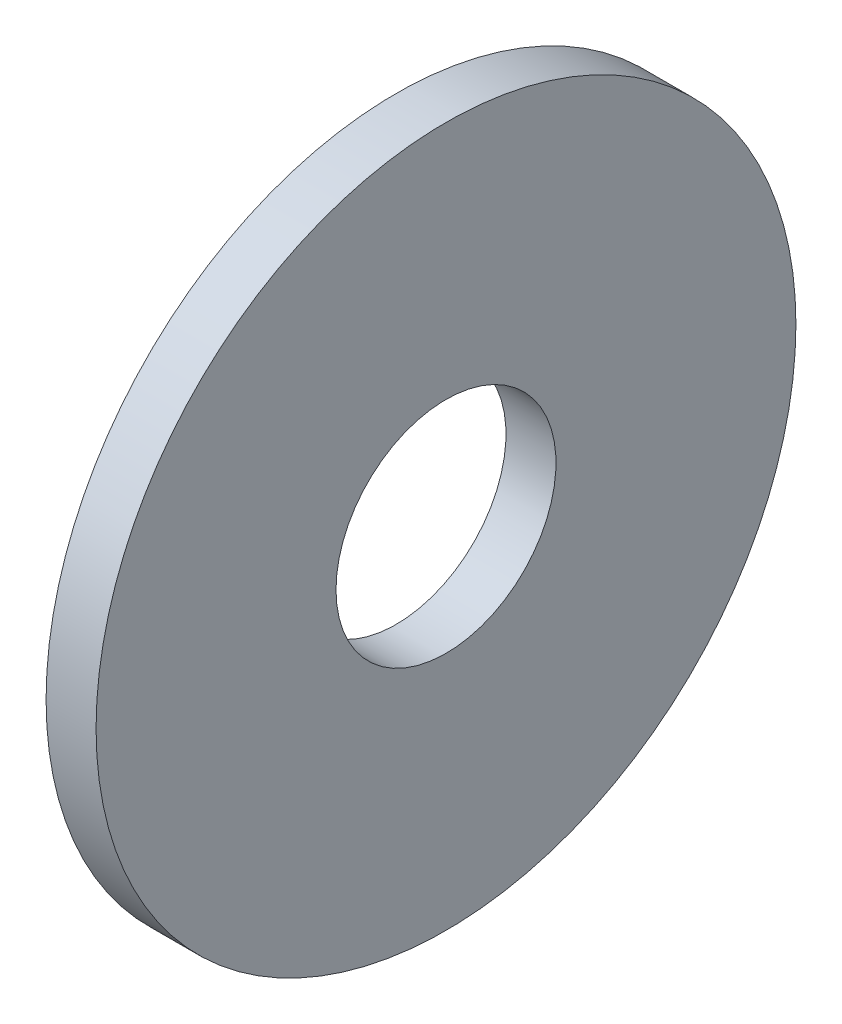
ISO-10303-21;
HEADER;
FILE_DESCRIPTION(('STEP AP214'),'2;1');
FILE_NAME('part.step','',(''),(''),'','','');
FILE_SCHEMA(('AUTOMOTIVE_DESIGN { 1 0 10303 214 1 1 1 1 }'));
ENDSEC;
DATA;
#1=APPLICATION_CONTEXT('core data for automotive mechanical design processes');
#2=APPLICATION_PROTOCOL_DEFINITION('international standard','automotive_design',2000,#1);
#3=PRODUCT_CONTEXT('',#1,'mechanical');
#4=PRODUCT('Part','Part','',(#3));
#5=PRODUCT_RELATED_PRODUCT_CATEGORY('part','',(#4));
#6=PRODUCT_DEFINITION_FORMATION('','',#4);
#7=PRODUCT_DEFINITION_CONTEXT('part definition',#1,'design');
#8=PRODUCT_DEFINITION('design','',#6,#7);
#9=PRODUCT_DEFINITION_SHAPE('','',#8);
#10=(LENGTH_UNIT() NAMED_UNIT(*) SI_UNIT(.MILLI.,.METRE.));
#11=(NAMED_UNIT(*) PLANE_ANGLE_UNIT() SI_UNIT($,.RADIAN.));
#12=(NAMED_UNIT(*) SI_UNIT($,.STERADIAN.) SOLID_ANGLE_UNIT());
#13=UNCERTAINTY_MEASURE_WITH_UNIT(LENGTH_MEASURE(1.E-05),#10,'distance_accuracy_value','');
#14=(GEOMETRIC_REPRESENTATION_CONTEXT(3) GLOBAL_UNCERTAINTY_ASSIGNED_CONTEXT((#13)) GLOBAL_UNIT_ASSIGNED_CONTEXT((#10,
#11,#12)) REPRESENTATION_CONTEXT('',''));
#15=CARTESIAN_POINT('',(0.,0.,0.));
#16=DIRECTION('',(0.,0.,1.));
#17=DIRECTION('',(1.,0.,0.));
#18=AXIS2_PLACEMENT_3D('',#15,#16,#17);
#19=CARTESIAN_POINT('',(0.,0.,-3.5));
#20=DIRECTION('',(1.,0.,0.));
#21=DIRECTION('',(0.,0.,-1.));
#22=AXIS2_PLACEMENT_3D('',#19,#20,#21);
#23=PLANE('',#22);
#24=CARTESIAN_POINT('',(0.,0.,0.));
#25=DIRECTION('',(-1.,0.,0.));
#26=DIRECTION('',(0.,0.,1.));
#27=AXIS2_PLACEMENT_3D('',#24,#25,#26);
#28=CIRCLE('',#27,1.1);
#29=CARTESIAN_POINT('',(0.,0.,1.1));
#30=VERTEX_POINT('',#29);
#31=EDGE_CURVE('E10',#30,#30,#28,.T.);
#32=ORIENTED_EDGE('',*,*,#31,.F.);
#33=EDGE_LOOP('',(#32));
#34=FACE_BOUND('',#33,.T.);
#35=CARTESIAN_POINT('',(0.,0.,0.));
#36=DIRECTION('',(-1.,0.,0.));
#37=DIRECTION('',(0.,0.,1.));
#38=AXIS2_PLACEMENT_3D('',#35,#36,#37);
#39=CIRCLE('',#38,3.5);
#40=CARTESIAN_POINT('',(0.,0.,3.5));
#41=VERTEX_POINT('',#40);
#42=EDGE_CURVE('E55',#41,#41,#39,.T.);
#43=ORIENTED_EDGE('',*,*,#42,.T.);
#44=EDGE_LOOP('',(#43));
#45=FACE_BOUND('',#44,.T.);
#46=ADVANCED_FACE('F41',(#34,#45),#23,.F.);
#47=CARTESIAN_POINT('',(0.,0.,0.));
#48=DIRECTION('',(-1.,0.,0.));
#49=DIRECTION('',(0.,0.,1.));
#50=AXIS2_PLACEMENT_3D('',#47,#48,#49);
#51=CYLINDRICAL_SURFACE('',#50,1.1);
#52=CARTESIAN_POINT('',(0.5,0.,0.));
#53=DIRECTION('',(-1.,0.,0.));
#54=DIRECTION('',(0.,0.,1.));
#55=AXIS2_PLACEMENT_3D('',#52,#53,#54);
#56=CIRCLE('',#55,1.1);
#57=CARTESIAN_POINT('',(0.5,0.,1.1));
#58=VERTEX_POINT('',#57);
#59=EDGE_CURVE('E47',#58,#58,#56,.T.);
#60=ORIENTED_EDGE('',*,*,#59,.F.);
#61=EDGE_LOOP('',(#60));
#62=FACE_BOUND('',#61,.T.);
#63=ORIENTED_EDGE('',*,*,#31,.T.);
#64=EDGE_LOOP('',(#63));
#65=FACE_BOUND('',#64,.T.);
#66=ADVANCED_FACE('F70',(#62,#65),#51,.F.);
#67=CARTESIAN_POINT('',(0.5,0.,-3.5));
#68=DIRECTION('',(-1.,0.,0.));
#69=DIRECTION('',(0.,0.,1.));
#70=AXIS2_PLACEMENT_3D('',#67,#68,#69);
#71=PLANE('',#70);
#72=CARTESIAN_POINT('',(0.5,0.,0.));
#73=DIRECTION('',(-1.,0.,0.));
#74=DIRECTION('',(0.,0.,1.));
#75=AXIS2_PLACEMENT_3D('',#72,#73,#74);
#76=CIRCLE('',#75,3.5);
#77=CARTESIAN_POINT('',(0.5,0.,3.5));
#78=VERTEX_POINT('',#77);
#79=EDGE_CURVE('E51',#78,#78,#76,.T.);
#80=ORIENTED_EDGE('',*,*,#79,.F.);
#81=EDGE_LOOP('',(#80));
#82=FACE_BOUND('',#81,.T.);
#83=ORIENTED_EDGE('',*,*,#59,.T.);
#84=EDGE_LOOP('',(#83));
#85=FACE_BOUND('',#84,.T.);
#86=ADVANCED_FACE('F65',(#82,#85),#71,.F.);
#87=CARTESIAN_POINT('',(0.,0.,0.));
#88=DIRECTION('',(-1.,0.,0.));
#89=DIRECTION('',(0.,0.,1.));
#90=AXIS2_PLACEMENT_3D('',#87,#88,#89);
#91=CYLINDRICAL_SURFACE('',#90,3.5);
#92=ORIENTED_EDGE('',*,*,#42,.F.);
#93=EDGE_LOOP('',(#92));
#94=FACE_BOUND('',#93,.T.);
#95=ORIENTED_EDGE('',*,*,#79,.T.);
#96=EDGE_LOOP('',(#95));
#97=FACE_BOUND('',#96,.T.);
#98=ADVANCED_FACE('F62',(#94,#97),#91,.T.);
#99=CLOSED_SHELL('',(#46,#66,#86,#98));
#100=MANIFOLD_SOLID_BREP('B2',#99);
#101=ADVANCED_BREP_SHAPE_REPRESENTATION('',(#18,#100),#14);
#102=SHAPE_DEFINITION_REPRESENTATION(#9,#101);
ENDSEC;
END-ISO-10303-21;
